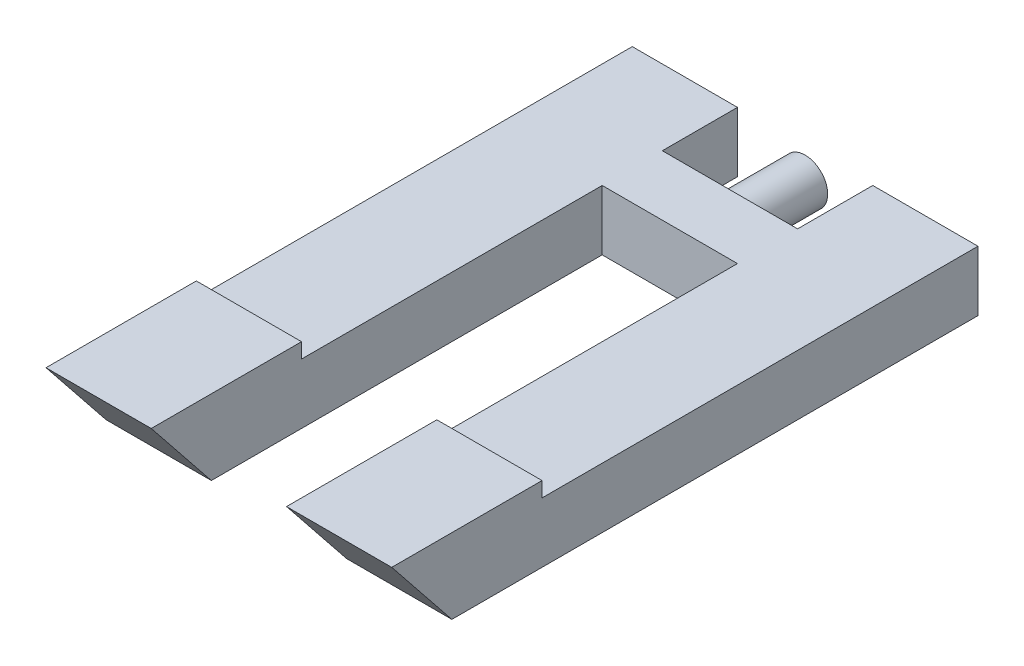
from build123d import *

# Parameters (mm, degrees)
BOSS_EXTRUDE1_DEPTH = 2
BOSS_EXTRUDE4_DEPTH = 7
SKETCH3_R           = 1.5
BOSS_EXTRUDE2_DEPTH = 5


with BuildPart() as part:
    # Sketch1 → Boss-Extrude1 (new, symmetric)
    with BuildSketch(Plane(origin=(0, 0, 0), x_dir=(1, 0, 0), z_dir=(0, 1, 0))):
        Polygon((-4.5, 0), (-4.5, 5), (-11.5, 5), (-11.5, -30), (-4.5, -30), (-4.5, -4), (0, -4), (0, 0), align=None)
    extrude(amount=BOSS_EXTRUDE1_DEPTH, both=True)

    # Sketch5 → Boss-Extrude4 (add)
    with BuildSketch(Plane.ZY.offset(11.5)):
        Polygon((30, 2), (24, 2), (24, 3), (34, 3), (30, -2), align=None)
    extrude(amount=-BOSS_EXTRUDE4_DEPTH)

    # Mirror1: part across plane


with BuildPart() as part_1:
    add(part.part)
    add(part.part.mirror(Plane(origin=(0, 2, 0), x_dir=(0, 0, 1), z_dir=(-1, 0, 0))))

    # Sketch3 → Boss-Extrude2 (add)
    with BuildSketch(Plane(origin=(0, 0, 0), x_dir=(-1, 0, 0), z_dir=(0, 0, -1))):
        with Locations(Location((0, 0, 0), (0, 0, 180))):
            Circle(SKETCH3_R)
    extrude(amount=BOSS_EXTRUDE2_DEPTH)


solid = part_1.part
